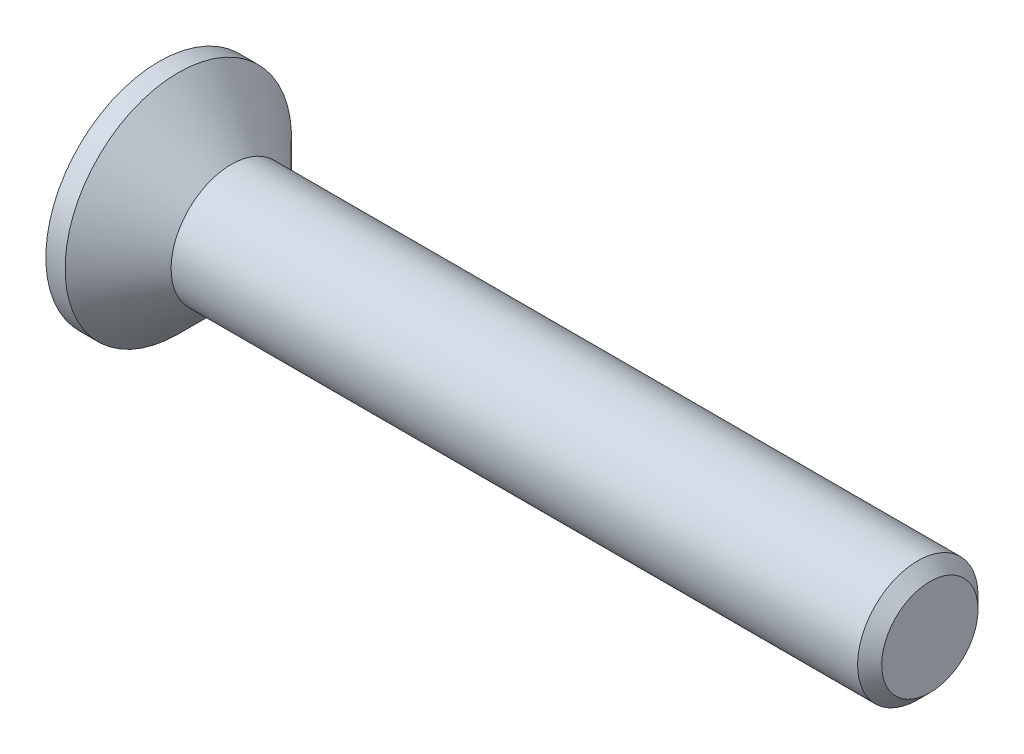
from build123d import *

# Parameters (mm, degrees)
CHAMFER1_SIZE      = 0.25
CUT_EXTRUDE1_DEPTH = 1.25


with BuildPart() as part:
    # Sketch1 → Revolve1 (revolve)
    with BuildSketch(Plane.XY, mode=Mode.PRIVATE) as revolve1_sk:
        Polygon((-1.5, 2.35), (-1.5, 0), (14.5, 0), (14.5, 1.25), (0, 1.25), (-1.1, 2.35), align=None)
    revolve(revolve1_sk.sketch.rotate(Axis((-1.5, 0, 0), (1, 0, 0)), 180), axis=Axis((-1.5, 0, 0), (1, 0, 0)))

    # Chamfer1
    chamfer1_edges = [part.edges().sort_by_distance(p)[0] for p in [
        (14.5, 1.25, 0),
    ]]
    chamfer(chamfer1_edges, length=CHAMFER1_SIZE)

    # Sketch2 → Cut-Extrude1 (cut)
    with BuildSketch(Plane.ZY.offset(1.5)):
        Polygon((-0.34, 1.35), (0.34, 1.35), (0.34, 0.34), (1.35, 0.34), (1.35, -0.34), (0.34, -0.34), (0.34, -1.35), (-0.34, -1.35), (-0.34, -0.34), (-1.35, -0.34), (-1.35, 0.34), (-0.34, 0.34), align=None)
    extrude(amount=-CUT_EXTRUDE1_DEPTH, mode=Mode.SUBTRACT)


solid = part.part
